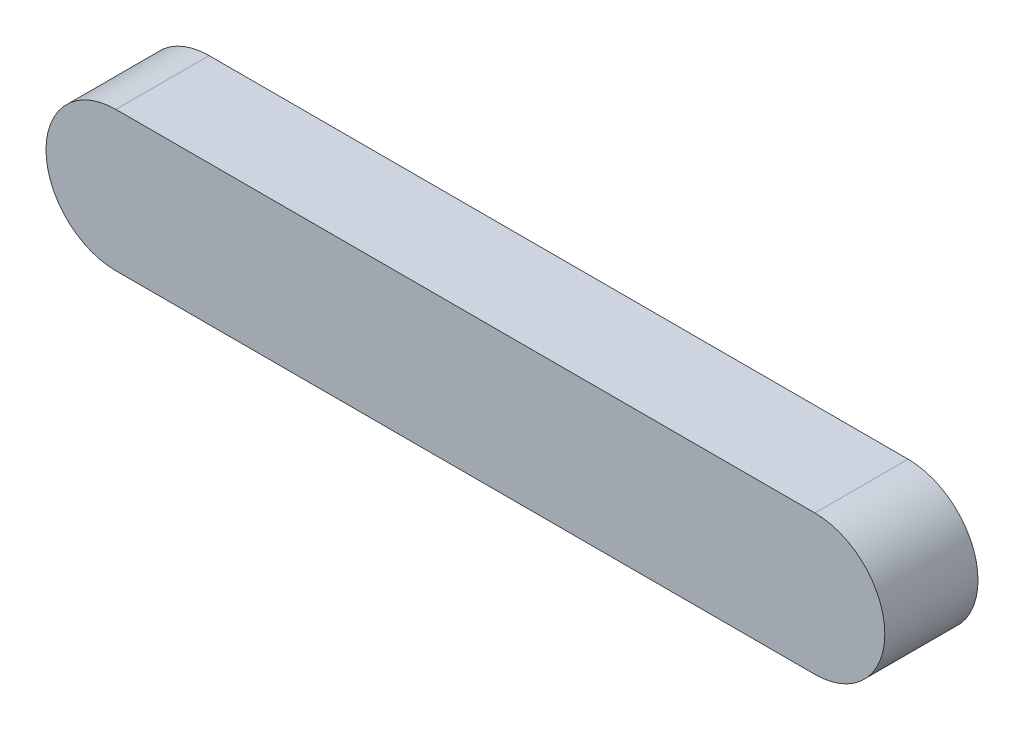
ISO-10303-21;
HEADER;
FILE_DESCRIPTION(('STEP AP214'),'2;1');
FILE_NAME('part.step','',(''),(''),'','','');
FILE_SCHEMA(('AUTOMOTIVE_DESIGN { 1 0 10303 214 1 1 1 1 }'));
ENDSEC;
DATA;
#1=APPLICATION_CONTEXT('core data for automotive mechanical design processes');
#2=APPLICATION_PROTOCOL_DEFINITION('international standard','automotive_design',2000,#1);
#3=PRODUCT_CONTEXT('',#1,'mechanical');
#4=PRODUCT('Part','Part','',(#3));
#5=PRODUCT_RELATED_PRODUCT_CATEGORY('part','',(#4));
#6=PRODUCT_DEFINITION_FORMATION('','',#4);
#7=PRODUCT_DEFINITION_CONTEXT('part definition',#1,'design');
#8=PRODUCT_DEFINITION('design','',#6,#7);
#9=PRODUCT_DEFINITION_SHAPE('','',#8);
#10=(LENGTH_UNIT() NAMED_UNIT(*) SI_UNIT(.MILLI.,.METRE.));
#11=(NAMED_UNIT(*) PLANE_ANGLE_UNIT() SI_UNIT($,.RADIAN.));
#12=(NAMED_UNIT(*) SI_UNIT($,.STERADIAN.) SOLID_ANGLE_UNIT());
#13=UNCERTAINTY_MEASURE_WITH_UNIT(LENGTH_MEASURE(1.E-05),#10,'distance_accuracy_value','');
#14=(GEOMETRIC_REPRESENTATION_CONTEXT(3) GLOBAL_UNCERTAINTY_ASSIGNED_CONTEXT((#13)) GLOBAL_UNIT_ASSIGNED_CONTEXT((#10,
#11,#12)) REPRESENTATION_CONTEXT('',''));
#15=CARTESIAN_POINT('',(0.,0.,0.));
#16=DIRECTION('',(0.,0.,1.));
#17=DIRECTION('',(1.,0.,0.));
#18=AXIS2_PLACEMENT_3D('',#15,#16,#17);
#19=CARTESIAN_POINT('',(0.,0.,4.));
#20=DIRECTION('',(0.,0.,-1.));
#21=DIRECTION('',(-1.,0.,0.));
#22=AXIS2_PLACEMENT_3D('',#19,#20,#21);
#23=CYLINDRICAL_SURFACE('',#22,3.);
#24=CARTESIAN_POINT('',(0.,0.,0.));
#25=DIRECTION('',(0.,0.,1.));
#26=DIRECTION('',(1.,0.,0.));
#27=AXIS2_PLACEMENT_3D('',#24,#25,#26);
#28=CIRCLE('',#27,3.);
#29=CARTESIAN_POINT('',(0.,3.,0.));
#30=VERTEX_POINT('',#29);
#31=CARTESIAN_POINT('',(0.,-3.,0.));
#32=VERTEX_POINT('',#31);
#33=EDGE_CURVE('E68',#30,#32,#28,.T.);
#34=ORIENTED_EDGE('',*,*,#33,.T.);
#35=DIRECTION('',(0.,0.,-1.));
#36=VECTOR('',#35,1.);
#37=CARTESIAN_POINT('',(0.,-3.,4.));
#38=LINE('',#37,#36);
#39=CARTESIAN_POINT('',(0.,-3.,4.));
#40=VERTEX_POINT('',#39);
#41=EDGE_CURVE('E11',#40,#32,#38,.T.);
#42=ORIENTED_EDGE('',*,*,#41,.F.);
#43=CARTESIAN_POINT('',(0.,0.,4.));
#44=DIRECTION('',(0.,0.,1.));
#45=DIRECTION('',(1.,0.,0.));
#46=AXIS2_PLACEMENT_3D('',#43,#44,#45);
#47=CIRCLE('',#46,3.);
#48=CARTESIAN_POINT('',(0.,3.,4.));
#49=VERTEX_POINT('',#48);
#50=EDGE_CURVE('E86',#49,#40,#47,.T.);
#51=ORIENTED_EDGE('',*,*,#50,.F.);
#52=DIRECTION('',(0.,0.,-1.));
#53=VECTOR('',#52,1.);
#54=CARTESIAN_POINT('',(0.,3.,4.));
#55=LINE('',#54,#53);
#56=EDGE_CURVE('E80',#49,#30,#55,.T.);
#57=ORIENTED_EDGE('',*,*,#56,.T.);
#58=EDGE_LOOP('',(#34,#42,#51,#57));
#59=FACE_BOUND('',#58,.T.);
#60=ADVANCED_FACE('F24',(#59),#23,.T.);
#61=CARTESIAN_POINT('',(0.,-3.,4.));
#62=DIRECTION('',(0.,1.,0.));
#63=DIRECTION('',(0.,0.,1.));
#64=AXIS2_PLACEMENT_3D('',#61,#62,#63);
#65=PLANE('',#64);
#66=DIRECTION('',(1.,0.,0.));
#67=VECTOR('',#66,1.);
#68=CARTESIAN_POINT('',(0.,-3.,0.));
#69=LINE('',#68,#67);
#70=CARTESIAN_POINT('',(30.,-3.,0.));
#71=VERTEX_POINT('',#70);
#72=EDGE_CURVE('E64',#32,#71,#69,.T.);
#73=ORIENTED_EDGE('',*,*,#72,.T.);
#74=DIRECTION('',(0.,0.,-1.));
#75=VECTOR('',#74,1.);
#76=CARTESIAN_POINT('',(30.,-3.,4.));
#77=LINE('',#76,#75);
#78=CARTESIAN_POINT('',(30.,-3.,4.));
#79=VERTEX_POINT('',#78);
#80=EDGE_CURVE('E31',#79,#71,#77,.T.);
#81=ORIENTED_EDGE('',*,*,#80,.F.);
#82=DIRECTION('',(1.,0.,0.));
#83=VECTOR('',#82,1.);
#84=CARTESIAN_POINT('',(0.,-3.,4.));
#85=LINE('',#84,#83);
#86=EDGE_CURVE('E76',#40,#79,#85,.T.);
#87=ORIENTED_EDGE('',*,*,#86,.F.);
#88=ORIENTED_EDGE('',*,*,#41,.T.);
#89=EDGE_LOOP('',(#73,#81,#87,#88));
#90=FACE_BOUND('',#89,.T.);
#91=ADVANCED_FACE('F75',(#90),#65,.F.);
#92=CARTESIAN_POINT('',(30.,0.,4.));
#93=DIRECTION('',(0.,0.,-1.));
#94=DIRECTION('',(-1.,0.,0.));
#95=AXIS2_PLACEMENT_3D('',#92,#93,#94);
#96=CYLINDRICAL_SURFACE('',#95,3.);
#97=CARTESIAN_POINT('',(30.,0.,0.));
#98=DIRECTION('',(0.,0.,1.));
#99=DIRECTION('',(1.,0.,0.));
#100=AXIS2_PLACEMENT_3D('',#97,#98,#99);
#101=CIRCLE('',#100,3.);
#102=CARTESIAN_POINT('',(30.,3.,0.));
#103=VERTEX_POINT('',#102);
#104=EDGE_CURVE('E69',#71,#103,#101,.T.);
#105=ORIENTED_EDGE('',*,*,#104,.T.);
#106=DIRECTION('',(0.,0.,-1.));
#107=VECTOR('',#106,1.);
#108=CARTESIAN_POINT('',(30.,3.,4.));
#109=LINE('',#108,#107);
#110=CARTESIAN_POINT('',(30.,3.,4.));
#111=VERTEX_POINT('',#110);
#112=EDGE_CURVE('E92',#111,#103,#109,.T.);
#113=ORIENTED_EDGE('',*,*,#112,.F.);
#114=CARTESIAN_POINT('',(30.,0.,4.));
#115=DIRECTION('',(0.,0.,1.));
#116=DIRECTION('',(1.,0.,0.));
#117=AXIS2_PLACEMENT_3D('',#114,#115,#116);
#118=CIRCLE('',#117,3.);
#119=EDGE_CURVE('E43',#79,#111,#118,.T.);
#120=ORIENTED_EDGE('',*,*,#119,.F.);
#121=ORIENTED_EDGE('',*,*,#80,.T.);
#122=EDGE_LOOP('',(#105,#113,#120,#121));
#123=FACE_BOUND('',#122,.T.);
#124=ADVANCED_FACE('F95',(#123),#96,.T.);
#125=CARTESIAN_POINT('',(0.,3.,4.));
#126=DIRECTION('',(0.,-1.,0.));
#127=DIRECTION('',(0.,0.,-1.));
#128=AXIS2_PLACEMENT_3D('',#125,#126,#127);
#129=PLANE('',#128);
#130=DIRECTION('',(-1.,0.,0.));
#131=VECTOR('',#130,1.);
#132=CARTESIAN_POINT('',(0.,3.,0.));
#133=LINE('',#132,#131);
#134=EDGE_CURVE('E84',#103,#30,#133,.T.);
#135=ORIENTED_EDGE('',*,*,#134,.T.);
#136=ORIENTED_EDGE('',*,*,#56,.F.);
#137=DIRECTION('',(-1.,0.,0.));
#138=VECTOR('',#137,1.);
#139=CARTESIAN_POINT('',(0.,3.,4.));
#140=LINE('',#139,#138);
#141=EDGE_CURVE('E38',#111,#49,#140,.T.);
#142=ORIENTED_EDGE('',*,*,#141,.F.);
#143=ORIENTED_EDGE('',*,*,#112,.T.);
#144=EDGE_LOOP('',(#135,#136,#142,#143));
#145=FACE_BOUND('',#144,.T.);
#146=ADVANCED_FACE('F97',(#145),#129,.F.);
#147=CARTESIAN_POINT('',(0.,0.,4.));
#148=DIRECTION('',(0.,0.,1.));
#149=DIRECTION('',(1.,0.,0.));
#150=AXIS2_PLACEMENT_3D('',#147,#148,#149);
#151=PLANE('',#150);
#152=ORIENTED_EDGE('',*,*,#50,.T.);
#153=ORIENTED_EDGE('',*,*,#86,.T.);
#154=ORIENTED_EDGE('',*,*,#119,.T.);
#155=ORIENTED_EDGE('',*,*,#141,.T.);
#156=EDGE_LOOP('',(#152,#153,#154,#155));
#157=FACE_BOUND('',#156,.T.);
#158=ADVANCED_FACE('F98',(#157),#151,.T.);
#159=CARTESIAN_POINT('',(0.,0.,0.));
#160=DIRECTION('',(0.,0.,1.));
#161=DIRECTION('',(1.,0.,0.));
#162=AXIS2_PLACEMENT_3D('',#159,#160,#161);
#163=PLANE('',#162);
#164=ORIENTED_EDGE('',*,*,#33,.F.);
#165=ORIENTED_EDGE('',*,*,#134,.F.);
#166=ORIENTED_EDGE('',*,*,#104,.F.);
#167=ORIENTED_EDGE('',*,*,#72,.F.);
#168=EDGE_LOOP('',(#164,#165,#166,#167));
#169=FACE_BOUND('',#168,.T.);
#170=ADVANCED_FACE('F65',(#169),#163,.F.);
#171=CLOSED_SHELL('',(#60,#91,#124,#146,#158,#170));
#172=MANIFOLD_SOLID_BREP('B2',#171);
#173=ADVANCED_BREP_SHAPE_REPRESENTATION('',(#18,#172),#14);
#174=SHAPE_DEFINITION_REPRESENTATION(#9,#173);
ENDSEC;
END-ISO-10303-21;
